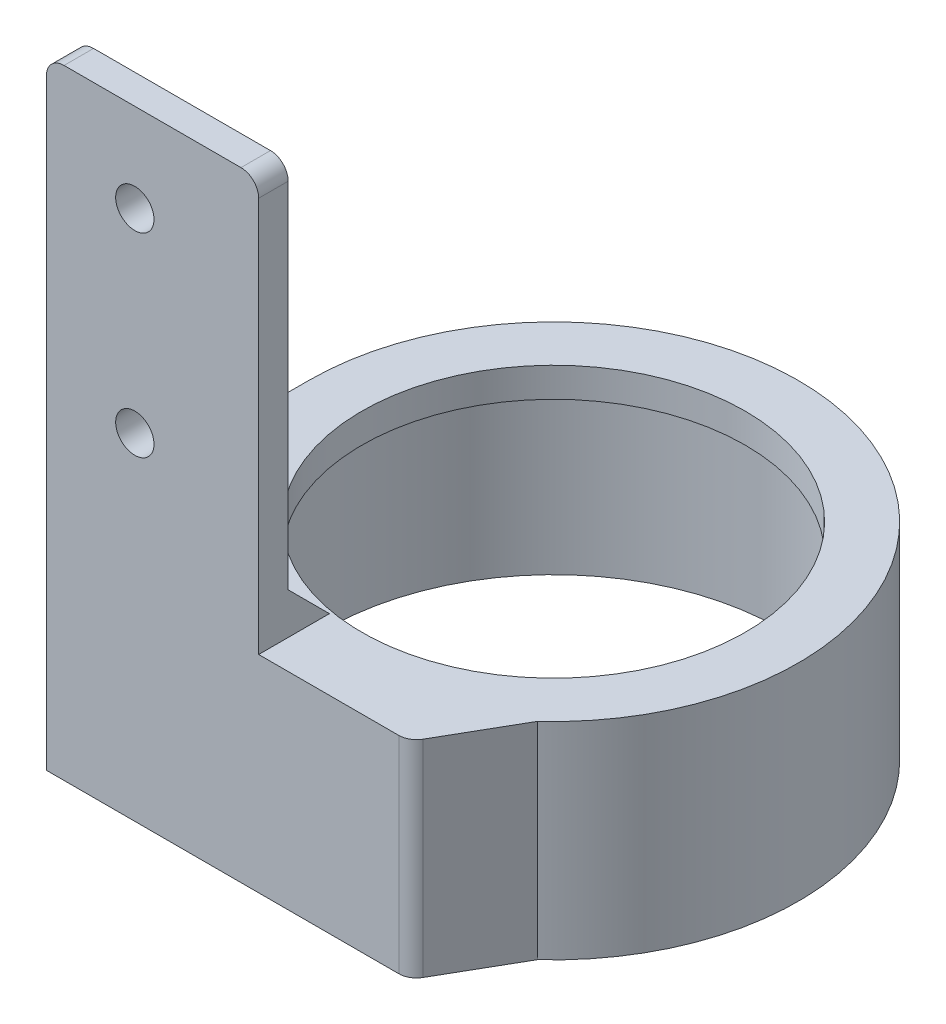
from build123d import *

# Parameters (mm, degrees)
SKIZZE1_R                       = 3.25
AUFSATZ_LINEAR_AUSTRAGEN1_DEPTH = 3
SKIZZE4_R                       = 41.5
AUFSATZ_LINEAR_AUSTRAGEN2_DEPTH = 35
SKIZZE6_R                       = 38.5
SCHNITT_LINEAR_AUSTRAGEN1_DEPTH = 160.091168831
SKIZZE7_R                       = 38.5
SKIZZE7_R_2                     = 32.5
LINEAR_AUSTRAGEN_D_NN1_DEPTH    = 5
SKIZZE16_W                      = 25.5
SKIZZE16_H                      = 35
AUFSATZ_LINEAR_AUSTRAGEN3_DEPTH = 3
AUFSATZ_LINEAR_AUSTRAGEN4_DEPTH = 35
AUFSATZ_LINEAR_AUSTRAGEN5_DEPTH = 35
SCHNITT_LINEAR_AUSTRAGEN3_DEPTH = 139.509927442
SKIZZE29_R                      = 3.25
AUFSATZ_LINEAR_AUSTRAGEN8_DEPTH = 2
AUFSATZ_LINEAR_AUSTRAGEN6_DEPTH = 36


with BuildPart() as part:
    # Skizze1 → Aufsatz-Linear austragen1 (new body)
    with BuildSketch(Plane.XY):
        with BuildLine():
            Line((3, 0), (33, 0))
            ThreePointArc((33, 0), (35.121320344, -0.878679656), (36, -3))
            Line((36, -3), (36, -97))
            Line((36, -97), (36, -105))
            Line((36, -105), (33, -105))
            Line((33, -105), (3, -105))
            Line((3, -105), (0, -105))
            Line((0, -105), (0, -97))
            Line((0, -97), (0, -3))
            ThreePointArc((0, -3), (0.878679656, -0.878679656), (3, 0))
        make_face()
        with Locations((15, -15)):
            Circle(SKIZZE1_R, mode=Mode.SUBTRACT)
        with Locations((15, -48)):
            Circle(SKIZZE1_R, mode=Mode.SUBTRACT)
    extrude(amount=AUFSATZ_LINEAR_AUSTRAGEN1_DEPTH)

    # Skizze16 → Aufsatz-Linear austragen3 (add)
    with BuildSketch(Plane(origin=(0, 0, 0), x_dir=(-1, 0, 0), z_dir=(0, 0, -1))):
        with Locations((-48.75, -87.5)):
            Rectangle(SKIZZE16_W, SKIZZE16_H)
    extrude(amount=-AUFSATZ_LINEAR_AUSTRAGEN3_DEPTH)



with BuildPart() as body_2:
    # Skizze4 → Aufsatz-Linear austragen2 (new body)
    with BuildSketch(Plane.XZ.offset(105)):
        with Locations(Location((41.5, 44.5, 0), (0, 0, 270))):
            Circle(SKIZZE4_R)
    extrude(amount=-AUFSATZ_LINEAR_AUSTRAGEN2_DEPTH)

    # Skizze6 → Schnitt-Linear austragen1 (cut, through all)
    with BuildSketch(Plane(origin=(0, -105, 0), x_dir=(-1, 0, 0), z_dir=(0, -1, 0))):
        with Locations(Location((-41.5, -44.5, 0), (0, 0, 90))):
            Circle(SKIZZE6_R)
    extrude(amount=-SCHNITT_LINEAR_AUSTRAGEN1_DEPTH, mode=Mode.SUBTRACT)

    # Skizze7 → Linear-Austragen-D_nn1 (add)
    with BuildSketch(Plane(origin=(0, -70, 0), x_dir=(1, 0, 0), z_dir=(0, 1, 0))):
        with Locations((41.5, -44.5)):
            Circle(SKIZZE7_R)
        with Locations((41.5, -44.5)):
            Circle(SKIZZE7_R_2, mode=Mode.SUBTRACT)
    extrude(amount=-LINEAR_AUSTRAGEN_D_NN1_DEPTH)


with BuildPart() as part_1:
    add(part.part)

    add(body_2.part)  # Aufsatz-Linear austragen4 merges body 2
    # Skizze17 → Aufsatz-Linear austragen4 (add)
    with BuildSketch(Plane.XZ.offset(105)):
        Polygon((69.453110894, 13.826337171), (65.463261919, 10.61767307), (61.157704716, 7.951065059), (56.456387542, 5.788806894), (51.630976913, 4.255580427), (46.581071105, 3.312226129), (41.5, 3), (61.5, 3), (61.5, 0), align=None)
    extrude(amount=-AUFSATZ_LINEAR_AUSTRAGEN4_DEPTH)

    # Skizze19 → Aufsatz-Linear austragen5 (add)
    with BuildSketch(Plane.XZ.offset(105)):
        Polygon((0, 44.5), (0.292769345, 39.579213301), (1.32012733, 34.115981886), (2.987465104, 29.039254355), (5.405172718, 24.020413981), (8.439906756, 19.41454137), (12.000641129, 15.310313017), (16.158896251, 11.635452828), (20.622161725, 8.634056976), (25.534528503, 6.193946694), (30.699904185, 4.429962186), (36.038410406, 3.360954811), (41.5, 3), (0, 3), align=None)
    extrude(amount=-AUFSATZ_LINEAR_AUSTRAGEN5_DEPTH)

    # Skizze21 → Schnitt-Linear austragen3 (cut, through all)
    with BuildSketch(Plane(origin=(0, -70, 0), x_dir=(1, 0, 0), z_dir=(0, 1, 0))):
        with BuildLine():
            Line((61.5, 0), (59.764741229, 0))
            ThreePointArc((59.764741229, 0), (61.266823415, -0.403127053), (62.365218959, -1.504167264))
            Line((62.365218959, -1.504167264), (61.5, 0))
        make_face()
    extrude(amount=-SCHNITT_LINEAR_AUSTRAGEN3_DEPTH, mode=Mode.SUBTRACT)

    # Skizze29 → Aufsatz-Linear austragen8 (add)
    with BuildSketch(Plane.XY.offset(3)):
        with BuildLine():
            Line((3, 0), (33, 0))
            ThreePointArc((33, 0), (35.121320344, -0.878679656), (36, -3))
            Line((36, -3), (36, -70))
            Line((36, -70), (0, -70))
            Line((0, -70), (0, -3))
            ThreePointArc((0, -3), (0.878679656, -0.878679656), (3, 0))
        make_face()
        with Locations((15, -15)):
            Circle(SKIZZE29_R, mode=Mode.SUBTRACT)
        with Locations((15, -48)):
            Circle(SKIZZE29_R, mode=Mode.SUBTRACT)
    extrude(amount=AUFSATZ_LINEAR_AUSTRAGEN8_DEPTH)

    # Skizze26 → Aufsatz-Linear austragen6 (add)
    with BuildSketch(Plane.ZY):
        Polygon((5, -70), (5, -63), (12, -70), align=None)
    extrude(amount=-AUFSATZ_LINEAR_AUSTRAGEN6_DEPTH)


with BuildPart() as body_2_2:
    # Spiegeln1: mirrored copy
    add(part_1.part.mirror(Plane(origin=(3, -3, 5), x_dir=(1, 0, 0), z_dir=(0, 0, 1))))


solid = body_2_2.part
